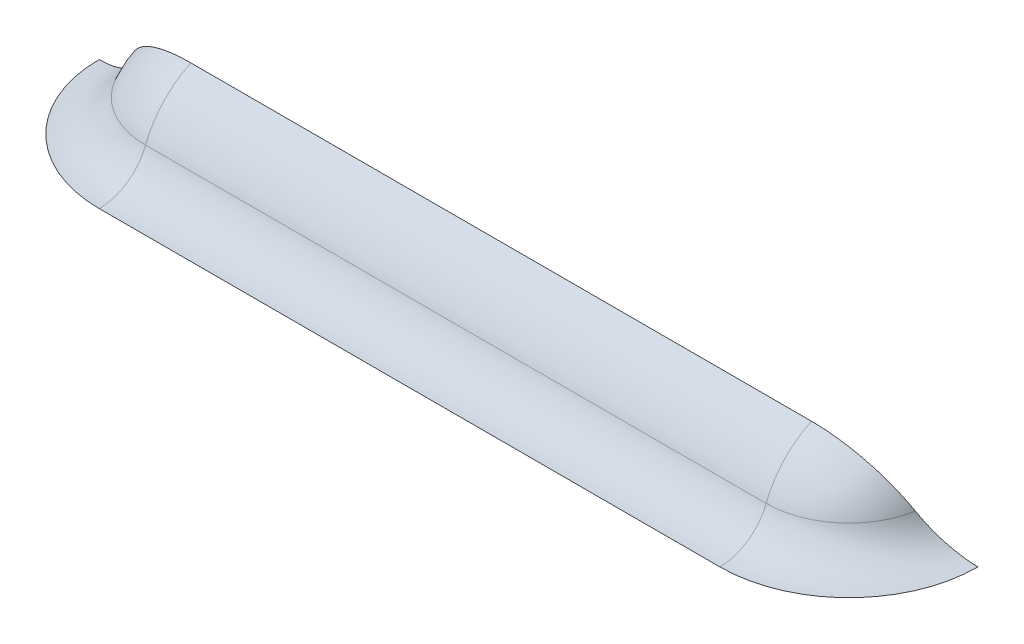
ISO-10303-21;
HEADER;
FILE_DESCRIPTION(('STEP AP214'),'2;1');
FILE_NAME('part.step','',(''),(''),'','','');
FILE_SCHEMA(('AUTOMOTIVE_DESIGN { 1 0 10303 214 1 1 1 1 }'));
ENDSEC;
DATA;
#1=APPLICATION_CONTEXT('core data for automotive mechanical design processes');
#2=APPLICATION_PROTOCOL_DEFINITION('international standard','automotive_design',2000,#1);
#3=PRODUCT_CONTEXT('',#1,'mechanical');
#4=PRODUCT('Part','Part','',(#3));
#5=PRODUCT_RELATED_PRODUCT_CATEGORY('part','',(#4));
#6=PRODUCT_DEFINITION_FORMATION('','',#4);
#7=PRODUCT_DEFINITION_CONTEXT('part definition',#1,'design');
#8=PRODUCT_DEFINITION('design','',#6,#7);
#9=PRODUCT_DEFINITION_SHAPE('','',#8);
#10=(LENGTH_UNIT() NAMED_UNIT(*) SI_UNIT(.MILLI.,.METRE.));
#11=(NAMED_UNIT(*) PLANE_ANGLE_UNIT() SI_UNIT($,.RADIAN.));
#12=(NAMED_UNIT(*) SI_UNIT($,.STERADIAN.) SOLID_ANGLE_UNIT());
#13=UNCERTAINTY_MEASURE_WITH_UNIT(LENGTH_MEASURE(1.E-05),#10,'distance_accuracy_value','');
#14=(GEOMETRIC_REPRESENTATION_CONTEXT(3) GLOBAL_UNCERTAINTY_ASSIGNED_CONTEXT((#13)) GLOBAL_UNIT_ASSIGNED_CONTEXT((#10,
#11,#12)) REPRESENTATION_CONTEXT('',''));
#15=CARTESIAN_POINT('',(0.,0.,0.));
#16=DIRECTION('',(0.,0.,1.));
#17=DIRECTION('',(1.,0.,0.));
#18=AXIS2_PLACEMENT_3D('',#15,#16,#17);
#19=CARTESIAN_POINT('',(19.05,3.46424361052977,-1.96581196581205));
#20=DIRECTION('',(-1.,0.,0.));
#21=DIRECTION('',(0.,0.,1.));
#22=AXIS2_PLACEMENT_3D('',#19,#20,#21);
#23=CYLINDRICAL_SURFACE('',#22,5.44444444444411);
#24=CARTESIAN_POINT('',(19.05,3.46424361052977,-1.96581196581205));
#25=DIRECTION('',(1.,0.,0.));
#26=DIRECTION('',(0.,0.,-1.));
#27=AXIS2_PLACEMENT_3D('',#24,#25,#26);
#28=CIRCLE('',#27,5.44444444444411);
#29=CARTESIAN_POINT('',(19.05,8.39858600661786,0.335109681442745));
#30=VERTEX_POINT('',#29);
#31=CARTESIAN_POINT('',(19.05,5.41829426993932,3.11588669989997));
#32=VERTEX_POINT('',#31);
#33=EDGE_CURVE('E89',#30,#32,#28,.T.);
#34=ORIENTED_EDGE('',*,*,#33,.F.);
#35=DIRECTION('',(1.,0.,0.));
#36=VECTOR('',#35,1.);
#37=CARTESIAN_POINT('',(-50.8,8.39858600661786,0.335109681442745));
#38=LINE('',#37,#36);
#39=CARTESIAN_POINT('',(-19.05,8.39858600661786,0.335109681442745));
#40=VERTEX_POINT('',#39);
#41=EDGE_CURVE('E126',#40,#30,#38,.T.);
#42=ORIENTED_EDGE('',*,*,#41,.F.);
#43=CARTESIAN_POINT('',(-19.05,3.46424361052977,-1.96581196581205));
#44=DIRECTION('',(1.,0.,0.));
#45=DIRECTION('',(0.,0.,-1.));
#46=AXIS2_PLACEMENT_3D('',#43,#44,#45);
#47=CIRCLE('',#46,5.44444444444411);
#48=CARTESIAN_POINT('',(-19.05,5.41829426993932,3.11588669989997));
#49=VERTEX_POINT('',#48);
#50=EDGE_CURVE('E54',#40,#49,#47,.T.);
#51=ORIENTED_EDGE('',*,*,#50,.T.);
#52=DIRECTION('',(-1.,0.,0.));
#53=VECTOR('',#52,1.);
#54=CARTESIAN_POINT('',(19.05,5.41829426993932,3.11588669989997));
#55=LINE('',#54,#53);
#56=EDGE_CURVE('E40',#49,#32,#55,.F.);
#57=ORIENTED_EDGE('',*,*,#56,.T.);
#58=EDGE_LOOP('',(#34,#42,#51,#57));
#59=FACE_BOUND('',#58,.T.);
#60=ADVANCED_FACE('F28',(#59),#23,.T.);
#61=CARTESIAN_POINT('',(-19.05,3.46424361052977,-1.96581196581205));
#62=DIRECTION('',(0.,1.,0.));
#63=DIRECTION('',(-1.,0.,0.));
#64=AXIS2_PLACEMENT_3D('',#61,#62,#63);
#65=SPHERICAL_SURFACE('',#64,5.44444444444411);
#66=ORIENTED_EDGE('',*,*,#50,.F.);
#67=CARTESIAN_POINT('',(-19.05,3.46424361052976,-1.96581196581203));
#68=DIRECTION('',(0.,-0.422618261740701,0.906307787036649));
#69=DIRECTION('',(0.,-0.906307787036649,-0.422618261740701));
#70=AXIS2_PLACEMENT_3D('',#67,#68,#69);
#71=CIRCLE('',#70,5.44444444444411);
#72=CARTESIAN_POINT('',(-24.0493395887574,5.41829426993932,-1.05462317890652));
#73=VERTEX_POINT('',#72);
#74=EDGE_CURVE('E113',#40,#73,#71,.T.);
#75=ORIENTED_EDGE('',*,*,#74,.T.);
#76=CARTESIAN_POINT('',(-19.05,5.41829426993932,-1.96581196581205));
#77=DIRECTION('',(0.,-1.,0.));
#78=DIRECTION('',(0.,0.,-1.));
#79=AXIS2_PLACEMENT_3D('',#76,#77,#78);
#80=CIRCLE('',#79,5.08169866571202);
#81=EDGE_CURVE('E101',#73,#49,#80,.F.);
#82=ORIENTED_EDGE('',*,*,#81,.T.);
#83=EDGE_LOOP('',(#66,#75,#82));
#84=FACE_BOUND('',#83,.T.);
#85=ADVANCED_FACE('F148',(#84),#65,.T.);
#86=CARTESIAN_POINT('',(19.05,3.46424361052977,-1.96581196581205));
#87=DIRECTION('',(0.,1.,0.));
#88=DIRECTION('',(1.,0.,0.));
#89=AXIS2_PLACEMENT_3D('',#86,#87,#88);
#90=SPHERICAL_SURFACE('',#89,5.44444444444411);
#91=CARTESIAN_POINT('',(19.05,5.41829426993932,-1.96581196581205));
#92=DIRECTION('',(0.,-1.,0.));
#93=DIRECTION('',(0.,0.,-1.));
#94=AXIS2_PLACEMENT_3D('',#91,#92,#93);
#95=CIRCLE('',#94,5.08169866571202);
#96=CARTESIAN_POINT('',(24.0493395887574,5.41829426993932,-1.05462317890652));
#97=VERTEX_POINT('',#96);
#98=EDGE_CURVE('E99',#32,#97,#95,.F.);
#99=ORIENTED_EDGE('',*,*,#98,.T.);
#100=CARTESIAN_POINT('',(19.05,3.46424361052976,-1.96581196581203));
#101=DIRECTION('',(0.,-0.422618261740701,0.906307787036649));
#102=DIRECTION('',(0.,-0.906307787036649,-0.422618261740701));
#103=AXIS2_PLACEMENT_3D('',#100,#101,#102);
#104=CIRCLE('',#103,5.44444444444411);
#105=EDGE_CURVE('E47',#97,#30,#104,.T.);
#106=ORIENTED_EDGE('',*,*,#105,.T.);
#107=ORIENTED_EDGE('',*,*,#33,.T.);
#108=EDGE_LOOP('',(#99,#106,#107));
#109=FACE_BOUND('',#108,.T.);
#110=ADVANCED_FACE('F146',(#109),#90,.T.);
#111=CARTESIAN_POINT('',(-19.05,6.51224361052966,-1.96581196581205));
#112=DIRECTION('',(0.,-1.,0.));
#113=DIRECTION('',(0.,0.,-1.));
#114=AXIS2_PLACEMENT_3D('',#111,#112,#113);
#115=TOROIDAL_SURFACE('',#114,7.92662025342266,3.048);
#116=ORIENTED_EDGE('',*,*,#81,.F.);
#117=CARTESIAN_POINT('',(-24.0492444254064,5.41849426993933,-1.05452991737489));
#118=CARTESIAN_POINT('',(-24.0748945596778,5.36458809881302,-1.0796667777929));
#119=CARTESIAN_POINT('',(-24.1018273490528,5.31118984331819,-1.10456679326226));
#120=CARTESIAN_POINT('',(-24.1582622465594,5.20554626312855,-1.1538292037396));
#121=CARTESIAN_POINT('',(-24.1877633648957,5.15330050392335,-1.17819180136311));
#122=CARTESIAN_POINT('',(-24.2803026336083,4.99819051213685,-1.25052077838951));
#123=CARTESIAN_POINT('',(-24.3472549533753,4.89721089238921,-1.29760834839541));
#124=CARTESIAN_POINT('',(-24.4920090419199,4.70107224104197,-1.38906930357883));
#125=CARTESIAN_POINT('',(-24.5698651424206,4.6059460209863,-1.43342738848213));
#126=CARTESIAN_POINT('',(-24.7361031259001,4.42359806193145,-1.51845763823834));
#127=CARTESIAN_POINT('',(-24.8244836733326,4.33637532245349,-1.55913026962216));
#128=CARTESIAN_POINT('',(-25.0434914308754,4.14339741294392,-1.64911734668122));
#129=CARTESIAN_POINT('',(-25.178272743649,4.04140809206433,-1.6966757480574));
#130=CARTESIAN_POINT('',(-25.3927002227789,3.9047597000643,-1.76039593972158));
#131=CARTESIAN_POINT('',(-25.4661625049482,3.86195728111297,-1.78035503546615));
#132=CARTESIAN_POINT('',(-25.6168578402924,3.78222763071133,-1.81753358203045));
#133=CARTESIAN_POINT('',(-25.6940891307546,3.74529768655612,-1.83475429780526));
#134=CARTESIAN_POINT('',(-25.8524808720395,3.67752377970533,-1.86635778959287));
#135=CARTESIAN_POINT('',(-25.9336673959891,3.64672983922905,-1.88071723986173));
#136=CARTESIAN_POINT('',(-26.0987808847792,3.59202851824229,-1.90622488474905));
#137=CARTESIAN_POINT('',(-26.182706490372,3.56811777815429,-1.91737464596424));
#138=CARTESIAN_POINT('',(-26.3525560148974,3.52752881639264,-1.93630158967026));
#139=CARTESIAN_POINT('',(-26.4384775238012,3.51084230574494,-1.94408263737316));
#140=CARTESIAN_POINT('',(-26.6116323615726,3.4849111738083,-1.95617452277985));
#141=CARTESIAN_POINT('',(-26.6988646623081,3.4756610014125,-1.96048794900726));
#142=CARTESIAN_POINT('',(-26.8180708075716,3.46820378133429,-1.96396530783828));
#143=CARTESIAN_POINT('',(-26.8498249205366,3.46671600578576,-1.96465906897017));
#144=CARTESIAN_POINT('',(-26.9133246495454,3.4647357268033,-1.96558248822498));
#145=CARTESIAN_POINT('',(-26.9450702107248,3.46424177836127,-1.96581282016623));
#146=CARTESIAN_POINT('',(-26.9768202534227,3.46424361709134,-1.96581196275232));
#147=B_SPLINE_CURVE_WITH_KNOTS('',3,(#117,#118,#119,#120,#121,#122,#123,#124,#125,#126,#127,
#128,#129,#130,#131,#132,#133,#134,#135,#136,#137,#138,#139,#140,#141,#142,#143,#144,#145,#146),
.UNSPECIFIED.,.F.,.F.,(4,2,2,2,2,2,2,2,2,2,2,2,2,2,4),(0.,0.194291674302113,0.388508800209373,
0.777866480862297,1.16923827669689,1.56056046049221,2.08477781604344,2.34651750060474,
2.60813592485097,2.87180693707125,3.13534903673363,3.39858794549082,3.66163016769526,
3.7570053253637,3.85224170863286),.UNSPECIFIED.);
#148=CARTESIAN_POINT('',(-26.9766202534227,3.46424361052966,-1.96581196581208));
#149=VERTEX_POINT('',#148);
#150=EDGE_CURVE('E117',#73,#149,#147,.T.);
#151=ORIENTED_EDGE('',*,*,#150,.T.);
#152=CARTESIAN_POINT('',(-19.05,3.46424361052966,-1.96581196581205));
#153=DIRECTION('',(0.,-1.,0.));
#154=DIRECTION('',(0.,0.,-1.));
#155=AXIS2_PLACEMENT_3D('',#152,#153,#154);
#156=CIRCLE('',#155,7.92662025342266);
#157=CARTESIAN_POINT('',(-19.05,3.46424361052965,5.9608082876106));
#158=VERTEX_POINT('',#157);
#159=EDGE_CURVE('E86',#158,#149,#156,.T.);
#160=ORIENTED_EDGE('',*,*,#159,.F.);
#161=CARTESIAN_POINT('',(-19.05,6.51224361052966,5.9608082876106));
#162=DIRECTION('',(-1.,0.,0.));
#163=DIRECTION('',(0.,0.,1.));
#164=AXIS2_PLACEMENT_3D('',#161,#162,#163);
#165=CIRCLE('',#164,3.048);
#166=EDGE_CURVE('E112',#49,#158,#165,.T.);
#167=ORIENTED_EDGE('',*,*,#166,.F.);
#168=EDGE_LOOP('',(#116,#151,#160,#167));
#169=FACE_BOUND('',#168,.T.);
#170=ADVANCED_FACE('F125',(#169),#115,.F.);
#171=CARTESIAN_POINT('',(19.05,6.51224361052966,5.9608082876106));
#172=DIRECTION('',(-1.,0.,0.));
#173=DIRECTION('',(0.,0.,1.));
#174=AXIS2_PLACEMENT_3D('',#171,#172,#173);
#175=CYLINDRICAL_SURFACE('',#174,3.048);
#176=ORIENTED_EDGE('',*,*,#166,.T.);
#177=DIRECTION('',(1.,0.,0.));
#178=VECTOR('',#177,1.);
#179=CARTESIAN_POINT('',(-19.05,3.46424361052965,5.9608082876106));
#180=LINE('',#179,#178);
#181=CARTESIAN_POINT('',(19.05,3.46424361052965,5.9608082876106));
#182=VERTEX_POINT('',#181);
#183=EDGE_CURVE('E88',#182,#158,#180,.F.);
#184=ORIENTED_EDGE('',*,*,#183,.F.);
#185=CARTESIAN_POINT('',(19.05,6.51224361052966,5.9608082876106));
#186=DIRECTION('',(-1.,0.,0.));
#187=DIRECTION('',(0.,-1.,0.));
#188=AXIS2_PLACEMENT_3D('',#185,#186,#187);
#189=CIRCLE('',#188,3.048);
#190=EDGE_CURVE('E97',#32,#182,#189,.T.);
#191=ORIENTED_EDGE('',*,*,#190,.F.);
#192=ORIENTED_EDGE('',*,*,#56,.F.);
#193=EDGE_LOOP('',(#176,#184,#191,#192));
#194=FACE_BOUND('',#193,.T.);
#195=ADVANCED_FACE('F111',(#194),#175,.F.);
#196=CARTESIAN_POINT('',(19.05,6.51224361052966,-1.96581196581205));
#197=DIRECTION('',(0.,-1.,0.));
#198=DIRECTION('',(0.,0.,-1.));
#199=AXIS2_PLACEMENT_3D('',#196,#197,#198);
#200=TOROIDAL_SURFACE('',#199,7.92662025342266,3.048);
#201=CARTESIAN_POINT('',(19.05,3.46424361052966,-1.96581196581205));
#202=DIRECTION('',(0.,-1.,0.));
#203=DIRECTION('',(0.,0.,-1.));
#204=AXIS2_PLACEMENT_3D('',#201,#202,#203);
#205=CIRCLE('',#204,7.92662025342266);
#206=CARTESIAN_POINT('',(26.9766202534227,3.46424361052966,-1.96581196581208));
#207=VERTEX_POINT('',#206);
#208=EDGE_CURVE('E83',#207,#182,#205,.T.);
#209=ORIENTED_EDGE('',*,*,#208,.F.);
#210=CARTESIAN_POINT('',(26.9768202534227,3.46424361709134,-1.96581196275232));
#211=CARTESIAN_POINT('',(26.8961756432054,3.46422525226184,-1.96582052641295));
#212=CARTESIAN_POINT('',(26.8155375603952,3.46743317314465,-1.96432464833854));
#213=CARTESIAN_POINT('',(26.6548989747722,3.48020298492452,-1.95836998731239));
#214=CARTESIAN_POINT('',(26.5748982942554,3.4897630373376,-1.95391206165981));
#215=CARTESIAN_POINT('',(26.4164492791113,3.5150846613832,-1.94210439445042));
#216=CARTESIAN_POINT('',(26.3379957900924,3.53081968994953,-1.93476703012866));
#217=CARTESIAN_POINT('',(26.1828719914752,3.56828542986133,-1.91729646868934));
#218=CARTESIAN_POINT('',(26.1062017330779,3.5900163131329,-1.90716319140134));
#219=CARTESIAN_POINT('',(25.8797588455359,3.66381613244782,-1.87274977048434));
#220=CARTESIAN_POINT('',(25.7333072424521,3.72453252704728,-1.84443725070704));
#221=CARTESIAN_POINT('',(25.452986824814,3.86622920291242,-1.77836300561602));
#222=CARTESIAN_POINT('',(25.3191243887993,3.94721968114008,-1.74059652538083));
#223=CARTESIAN_POINT('',(25.0590339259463,4.13119643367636,-1.65480675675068));
#224=CARTESIAN_POINT('',(24.9336507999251,4.23515910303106,-1.60632816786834));
#225=CARTESIAN_POINT('',(24.7003829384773,4.45826229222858,-1.50229344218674));
#226=CARTESIAN_POINT('',(24.5925227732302,4.57742371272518,-1.44672755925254));
#227=CARTESIAN_POINT('',(24.4051676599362,4.81408647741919,-1.33636989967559));
#228=CARTESIAN_POINT('',(24.3238810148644,4.93043801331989,-1.282114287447));
#229=CARTESIAN_POINT('',(24.1758612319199,5.16984068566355,-1.17047898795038));
#230=CARTESIAN_POINT('',(24.1090639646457,5.29285915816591,-1.113114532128));
#231=CARTESIAN_POINT('',(24.0492444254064,5.41849426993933,-1.05452991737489));
#232=B_SPLINE_CURVE_WITH_KNOTS('',3,(#210,#211,#212,#213,#214,#215,#216,#217,#218,#219,#220,
#221,#222,#223,#224,#225,#226,#227,#228,#229,#230,#231),.UNSPECIFIED.,.F.,.F.,(4,2,2,2,2,2,2,2,
2,2,4),(0.,0.241844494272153,0.483619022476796,0.724365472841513,0.965118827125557,
1.44588264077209,1.92688874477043,2.43477974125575,2.94337685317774,3.39834621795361,
3.85125884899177),.UNSPECIFIED.);
#233=EDGE_CURVE('E11',#207,#97,#232,.T.);
#234=ORIENTED_EDGE('',*,*,#233,.T.);
#235=ORIENTED_EDGE('',*,*,#98,.F.);
#236=ORIENTED_EDGE('',*,*,#190,.T.);
#237=EDGE_LOOP('',(#209,#234,#235,#236));
#238=FACE_BOUND('',#237,.T.);
#239=ADVANCED_FACE('F95',(#238),#200,.F.);
#240=CARTESIAN_POINT('',(-50.8,3.46424361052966,-1.96581196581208));
#241=DIRECTION('',(0.,-0.422618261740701,0.906307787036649));
#242=DIRECTION('',(0.,-0.906307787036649,-0.422618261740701));
#243=AXIS2_PLACEMENT_3D('',#240,#241,#242);
#244=PLANE('',#243);
#245=ORIENTED_EDGE('',*,*,#41,.T.);
#246=ORIENTED_EDGE('',*,*,#105,.F.);
#247=ORIENTED_EDGE('',*,*,#233,.F.);
#248=DIRECTION('',(-1.,0.,0.));
#249=VECTOR('',#248,1.);
#250=CARTESIAN_POINT('',(19.05,3.46424361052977,-1.96581196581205));
#251=LINE('',#250,#249);
#252=EDGE_CURVE('E80',#207,#149,#251,.T.);
#253=ORIENTED_EDGE('',*,*,#252,.T.);
#254=ORIENTED_EDGE('',*,*,#150,.F.);
#255=ORIENTED_EDGE('',*,*,#74,.F.);
#256=EDGE_LOOP('',(#245,#246,#247,#253,#254,#255));
#257=FACE_BOUND('',#256,.T.);
#258=ADVANCED_FACE('F91',(#257),#244,.F.);
#259=CARTESIAN_POINT('',(50.8,3.46424361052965,25.4));
#260=DIRECTION('',(0.,1.,0.));
#261=DIRECTION('',(0.,0.,1.));
#262=AXIS2_PLACEMENT_3D('',#259,#260,#261);
#263=PLANE('',#262);
#264=ORIENTED_EDGE('',*,*,#252,.F.);
#265=ORIENTED_EDGE('',*,*,#208,.T.);
#266=ORIENTED_EDGE('',*,*,#183,.T.);
#267=ORIENTED_EDGE('',*,*,#159,.T.);
#268=EDGE_LOOP('',(#264,#265,#266,#267));
#269=FACE_BOUND('',#268,.T.);
#270=ADVANCED_FACE('F81',(#269),#263,.F.);
#271=CLOSED_SHELL('',(#60,#85,#110,#170,#195,#239,#258,#270));
#272=MANIFOLD_SOLID_BREP('B2',#271);
#273=ADVANCED_BREP_SHAPE_REPRESENTATION('',(#18,#272),#14);
#274=SHAPE_DEFINITION_REPRESENTATION(#9,#273);
ENDSEC;
END-ISO-10303-21;
